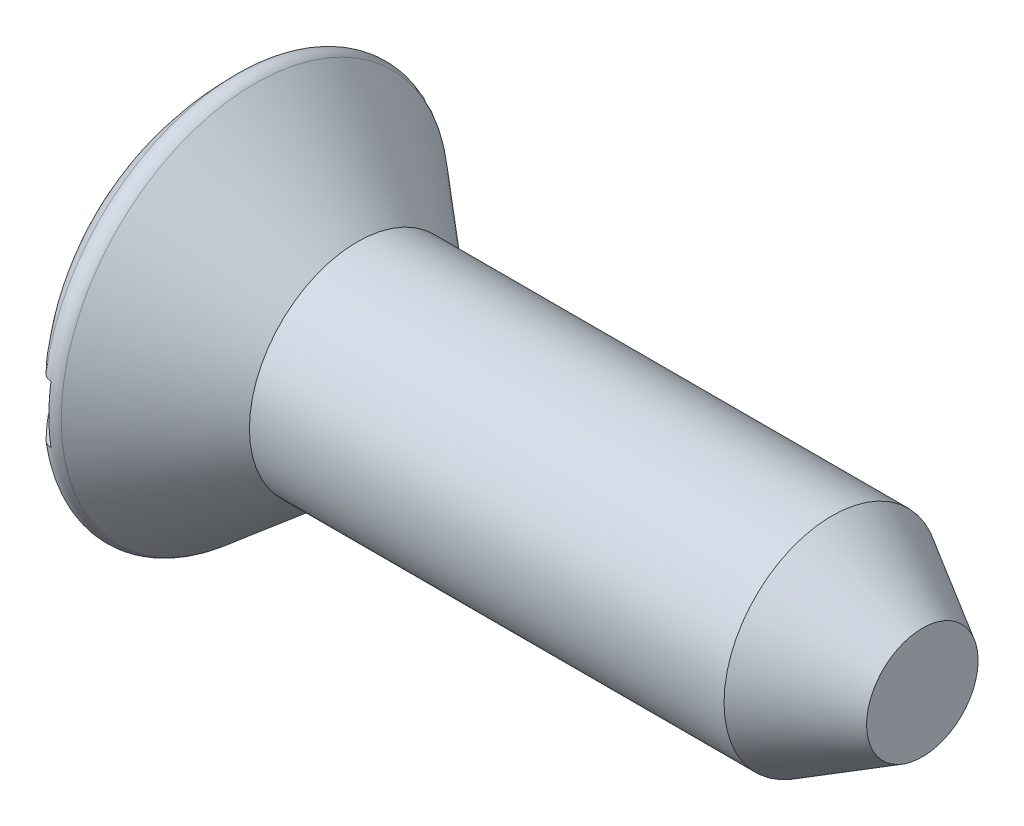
ISO-10303-21;
HEADER;
FILE_DESCRIPTION(('STEP AP214'),'2;1');
FILE_NAME('part.step','',(''),(''),'','','');
FILE_SCHEMA(('AUTOMOTIVE_DESIGN { 1 0 10303 214 1 1 1 1 }'));
ENDSEC;
DATA;
#1=APPLICATION_CONTEXT('core data for automotive mechanical design processes');
#2=APPLICATION_PROTOCOL_DEFINITION('international standard','automotive_design',2000,#1);
#3=PRODUCT_CONTEXT('',#1,'mechanical');
#4=PRODUCT('Part','Part','',(#3));
#5=PRODUCT_RELATED_PRODUCT_CATEGORY('part','',(#4));
#6=PRODUCT_DEFINITION_FORMATION('','',#4);
#7=PRODUCT_DEFINITION_CONTEXT('part definition',#1,'design');
#8=PRODUCT_DEFINITION('design','',#6,#7);
#9=PRODUCT_DEFINITION_SHAPE('','',#8);
#10=(LENGTH_UNIT() NAMED_UNIT(*) SI_UNIT(.MILLI.,.METRE.));
#11=(NAMED_UNIT(*) PLANE_ANGLE_UNIT() SI_UNIT($,.RADIAN.));
#12=(NAMED_UNIT(*) SI_UNIT($,.STERADIAN.) SOLID_ANGLE_UNIT());
#13=UNCERTAINTY_MEASURE_WITH_UNIT(LENGTH_MEASURE(1.E-05),#10,'distance_accuracy_value','');
#14=(GEOMETRIC_REPRESENTATION_CONTEXT(3) GLOBAL_UNCERTAINTY_ASSIGNED_CONTEXT((#13)) GLOBAL_UNIT_ASSIGNED_CONTEXT((#10,
#11,#12)) REPRESENTATION_CONTEXT('',''));
#15=CARTESIAN_POINT('',(0.,0.,0.));
#16=DIRECTION('',(0.,0.,1.));
#17=DIRECTION('',(1.,0.,0.));
#18=AXIS2_PLACEMENT_3D('',#15,#16,#17);
#19=CARTESIAN_POINT('',(0.,0.,0.));
#20=DIRECTION('',(-1.,0.,0.));
#21=DIRECTION('',(0.,0.,1.));
#22=AXIS2_PLACEMENT_3D('',#19,#20,#21);
#23=CYLINDRICAL_SURFACE('',#22,0.762);
#24=CARTESIAN_POINT('',(0.787034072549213,0.,0.));
#25=DIRECTION('',(-1.,0.,0.));
#26=DIRECTION('',(0.,0.,1.));
#27=AXIS2_PLACEMENT_3D('',#24,#25,#26);
#28=CIRCLE('',#27,0.762);
#29=CARTESIAN_POINT('',(0.787034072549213,0.,0.762));
#30=VERTEX_POINT('',#29);
#31=EDGE_CURVE('E164',#30,#30,#28,.T.);
#32=ORIENTED_EDGE('',*,*,#31,.F.);
#33=EDGE_LOOP('',(#32));
#34=FACE_BOUND('',#33,.T.);
#35=CARTESIAN_POINT('',(4.13728568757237,0.,0.));
#36=DIRECTION('',(-1.,0.,0.));
#37=DIRECTION('',(0.,0.,1.));
#38=AXIS2_PLACEMENT_3D('',#35,#36,#37);
#39=CIRCLE('',#38,0.762);
#40=CARTESIAN_POINT('',(4.13728568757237,0.,0.762));
#41=VERTEX_POINT('',#40);
#42=EDGE_CURVE('E190',#41,#41,#39,.T.);
#43=ORIENTED_EDGE('',*,*,#42,.T.);
#44=EDGE_LOOP('',(#43));
#45=FACE_BOUND('',#44,.T.);
#46=ADVANCED_FACE('F76',(#34,#45),#23,.T.);
#47=CARTESIAN_POINT('',(1.27448752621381,0.,0.));
#48=DIRECTION('',(-1.,0.,0.));
#49=DIRECTION('',(0.,1.,0.));
#50=AXIS2_PLACEMENT_3D('',#47,#48,#49);
#51=SPHERICAL_SURFACE('',#50,1.9098534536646);
#52=CARTESIAN_POINT('',(-0.0629338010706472,0.,0.));
#53=DIRECTION('',(-1.,0.,0.));
#54=DIRECTION('',(0.,0.,1.));
#55=AXIS2_PLACEMENT_3D('',#52,#53,#54);
#56=CIRCLE('',#55,1.36339444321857);
#57=CARTESIAN_POINT('',(-0.0629338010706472,0.2032,1.34816696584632));
#58=VERTEX_POINT('',#57);
#59=CARTESIAN_POINT('',(-0.0629338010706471,0.2032,-1.34816696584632));
#60=VERTEX_POINT('',#59);
#61=EDGE_CURVE('E174',#58,#60,#56,.T.);
#62=ORIENTED_EDGE('',*,*,#61,.T.);
#63=CARTESIAN_POINT('',(1.27448752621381,0.2032,0.));
#64=DIRECTION('',(0.,1.,0.));
#65=DIRECTION('',(-1.,0.,0.));
#66=AXIS2_PLACEMENT_3D('',#63,#64,#65);
#67=CIRCLE('',#66,1.89901289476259);
#68=EDGE_CURVE('E104',#60,#58,#67,.T.);
#69=ORIENTED_EDGE('',*,*,#68,.T.);
#70=EDGE_LOOP('',(#62,#69));
#71=FACE_BOUND('',#70,.T.);
#72=ADVANCED_FACE('F186',(#71),#51,.T.);
#73=CARTESIAN_POINT('',(-0.0629338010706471,-0.2032,-1.34816696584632));
#74=VERTEX_POINT('',#73);
#75=CARTESIAN_POINT('',(-0.0629338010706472,-0.2032,1.34816696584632));
#76=VERTEX_POINT('',#75);
#77=EDGE_CURVE('E141',#74,#76,#56,.T.);
#78=ORIENTED_EDGE('',*,*,#77,.T.);
#79=CARTESIAN_POINT('',(1.27448752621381,-0.2032,0.));
#80=DIRECTION('',(0.,-1.,0.));
#81=DIRECTION('',(1.,0.,0.));
#82=AXIS2_PLACEMENT_3D('',#79,#80,#81);
#83=CIRCLE('',#82,1.89901289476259);
#84=EDGE_CURVE('E96',#76,#74,#83,.T.);
#85=ORIENTED_EDGE('',*,*,#84,.T.);
#86=EDGE_LOOP('',(#78,#85));
#87=FACE_BOUND('',#86,.T.);
#88=ADVANCED_FACE('F78',(#87),#51,.T.);
#89=CARTESIAN_POINT('',(0.787034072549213,0.,0.));
#90=DIRECTION('',(-1.,0.,0.));
#91=DIRECTION('',(0.,0.,1.));
#92=AXIS2_PLACEMENT_3D('',#89,#90,#91);
#93=CONICAL_SURFACE('',#92,0.762,0.698131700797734);
#94=CARTESIAN_POINT('',(0.0644242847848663,0.,0.));
#95=DIRECTION('',(-1.,0.,0.));
#96=DIRECTION('',(0.,0.,1.));
#97=AXIS2_PLACEMENT_3D('',#94,#95,#96);
#98=CIRCLE('',#97,1.36834160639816);
#99=CARTESIAN_POINT('',(0.0644242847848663,0.,1.36834160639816));
#100=VERTEX_POINT('',#99);
#101=EDGE_CURVE('E176',#100,#100,#98,.T.);
#102=ORIENTED_EDGE('',*,*,#101,.F.);
#103=EDGE_LOOP('',(#102));
#104=FACE_BOUND('',#103,.T.);
#105=ORIENTED_EDGE('',*,*,#31,.T.);
#106=EDGE_LOOP('',(#105));
#107=FACE_BOUND('',#106,.T.);
#108=ADVANCED_FACE('F182',(#104,#107),#93,.T.);
#109=CARTESIAN_POINT('',(0.00347087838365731,0.,0.));
#110=DIRECTION('',(-1.,0.,0.));
#111=DIRECTION('',(0.,0.,1.));
#112=AXIS2_PLACEMENT_3D('',#109,#110,#111);
#113=TOROIDAL_SURFACE('',#112,1.29570016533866,0.0948266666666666);
#114=CARTESIAN_POINT('',(-0.000365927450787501,0.,0.));
#115=DIRECTION('',(1.,0.,0.));
#116=DIRECTION('',(0.,0.,-1.));
#117=AXIS2_PLACEMENT_3D('',#114,#115,#116);
#118=CIRCLE('',#117,1.39044917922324);
#119=CARTESIAN_POINT('',(-0.000365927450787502,-0.2032,-1.3755212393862));
#120=VERTEX_POINT('',#119);
#121=CARTESIAN_POINT('',(-0.000365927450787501,0.2032,-1.37552123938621));
#122=VERTEX_POINT('',#121);
#123=EDGE_CURVE('E89',#120,#122,#118,.T.);
#124=ORIENTED_EDGE('',*,*,#123,.T.);
#125=CARTESIAN_POINT('',(-0.0212566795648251,0.2032,-1.37228324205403));
#126=CARTESIAN_POINT('',(-0.0263813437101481,0.2032,-1.37088366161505));
#127=CARTESIAN_POINT('',(-0.0313909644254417,0.2032,-1.36904755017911));
#128=CARTESIAN_POINT('',(-0.0410337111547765,0.2032,-1.36455645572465));
#129=CARTESIAN_POINT('',(-0.0456663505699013,0.2032,-1.36190043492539));
#130=CARTESIAN_POINT('',(-0.0544171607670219,0.2032,-1.35585170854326));
#131=CARTESIAN_POINT('',(-0.0585357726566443,0.2032,-1.35245964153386));
#132=CARTESIAN_POINT('',(-0.0661488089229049,0.2032,-1.34503770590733));
#133=CARTESIAN_POINT('',(-0.0696433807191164,0.2032,-1.34100798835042));
#134=CARTESIAN_POINT('',(-0.0759392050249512,0.2032,-1.33239429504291));
#135=CARTESIAN_POINT('',(-0.0787352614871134,0.2032,-1.32780652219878));
#136=CARTESIAN_POINT('',(-0.0835272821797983,0.2032,-1.31823043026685));
#137=CARTESIAN_POINT('',(-0.0855231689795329,0.2032,-1.31324207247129));
#138=CARTESIAN_POINT('',(-0.0886806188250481,0.2032,-1.30294780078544));
#139=CARTESIAN_POINT('',(-0.0898327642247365,0.2032,-1.29763899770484));
#140=CARTESIAN_POINT('',(-0.0912372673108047,0.2032,-1.28690363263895));
#141=CARTESIAN_POINT('',(-0.091489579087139,0.2032,-1.28147706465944));
#142=CARTESIAN_POINT('',(-0.0910870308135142,0.2032,-1.27061403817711));
#143=CARTESIAN_POINT('',(-0.0904248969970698,0.2032,-1.26517784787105));
#144=CARTESIAN_POINT('',(-0.0881986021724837,0.2032,-1.25449327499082));
#145=CARTESIAN_POINT('',(-0.0866344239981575,0.2032,-1.24924489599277));
#146=CARTESIAN_POINT('',(-0.0826436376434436,0.2032,-1.23907987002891));
#147=CARTESIAN_POINT('',(-0.0802160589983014,0.2032,-1.23416360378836));
#148=CARTESIAN_POINT('',(-0.0745642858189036,0.2032,-1.22481230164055));
#149=CARTESIAN_POINT('',(-0.0713401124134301,0.2032,-1.22037725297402));
#150=CARTESIAN_POINT('',(-0.0642096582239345,0.2032,-1.21215018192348));
#151=CARTESIAN_POINT('',(-0.0603084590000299,0.2032,-1.20835375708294));
#152=CARTESIAN_POINT('',(-0.0519167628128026,0.2032,-1.20148016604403));
#153=CARTESIAN_POINT('',(-0.0474263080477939,0.2032,-1.19840294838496));
#154=CARTESIAN_POINT('',(-0.03804572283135,0.2032,-1.19309806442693));
#155=CARTESIAN_POINT('',(-0.0331615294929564,0.2032,-1.19085990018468));
#156=CARTESIAN_POINT('',(-0.0230835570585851,0.2032,-1.18724721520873));
#157=CARTESIAN_POINT('',(-0.0178898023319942,0.2032,-1.18587262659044));
#158=CARTESIAN_POINT('',(-0.00740999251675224,0.2032,-1.1840421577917));
#159=CARTESIAN_POINT('',(-0.00212590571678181,0.2032,-1.18357499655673));
#160=CARTESIAN_POINT('',(0.00844513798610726,0.2032,-1.18353982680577));
#161=CARTESIAN_POINT('',(0.0137320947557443,0.2032,-1.18397177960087));
#162=CARTESIAN_POINT('',(0.0241287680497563,0.2032,-1.18571642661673));
#163=CARTESIAN_POINT('',(0.0292392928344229,0.2032,-1.18702431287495));
#164=CARTESIAN_POINT('',(0.0391697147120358,0.2032,-1.19047576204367));
#165=CARTESIAN_POINT('',(0.043989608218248,0.2032,-1.1926193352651));
#166=CARTESIAN_POINT('',(0.0532266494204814,0.2032,-1.19768908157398));
#167=CARTESIAN_POINT('',(0.0576418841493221,0.2032,-1.20061873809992));
#168=CARTESIAN_POINT('',(0.0659253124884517,0.2032,-1.20716955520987));
#169=CARTESIAN_POINT('',(0.0697934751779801,0.2032,-1.21079075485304));
#170=CARTESIAN_POINT('',(0.0769227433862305,0.2032,-1.21866740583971));
#171=CARTESIAN_POINT('',(0.0801760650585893,0.2032,-1.22292990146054));
#172=CARTESIAN_POINT('',(0.0859319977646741,0.2032,-1.23193469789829));
#173=CARTESIAN_POINT('',(0.0884345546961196,0.2032,-1.23667703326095));
#174=CARTESIAN_POINT('',(0.092651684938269,0.2032,-1.246574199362));
#175=CARTESIAN_POINT('',(0.0943554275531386,0.2032,-1.2517336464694));
#176=CARTESIAN_POINT('',(0.0968806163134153,0.2032,-1.26226416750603));
#177=CARTESIAN_POINT('',(0.0977020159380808,0.2032,-1.26763525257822));
#178=CARTESIAN_POINT('',(0.0984435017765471,0.2032,-1.2784843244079));
#179=CARTESIAN_POINT('',(0.0983560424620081,0.2032,-1.28396282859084));
#180=CARTESIAN_POINT('',(0.0972629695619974,0.2032,-1.29482761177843));
#181=CARTESIAN_POINT('',(0.0962573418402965,0.2032,-1.30021388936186));
#182=CARTESIAN_POINT('',(0.0933534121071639,0.2032,-1.31074162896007));
#183=CARTESIAN_POINT('',(0.0914549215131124,0.2032,-1.31588303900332));
#184=CARTESIAN_POINT('',(0.0868156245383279,0.2032,-1.32577082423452));
#185=CARTESIAN_POINT('',(0.0840748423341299,0.2032,-1.33051721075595));
#186=CARTESIAN_POINT('',(0.0778483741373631,0.2032,-1.33944284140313));
#187=CARTESIAN_POINT('',(0.0743681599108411,0.2032,-1.34362590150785));
#188=CARTESIAN_POINT('',(0.0667479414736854,0.2032,-1.35134012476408));
#189=CARTESIAN_POINT('',(0.0626080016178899,0.2032,-1.35487135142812));
#190=CARTESIAN_POINT('',(0.0538347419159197,0.2032,-1.36114030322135));
#191=CARTESIAN_POINT('',(0.0492073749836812,0.2032,-1.3638863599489));
#192=CARTESIAN_POINT('',(0.0395524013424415,0.2032,-1.36855408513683));
#193=CARTESIAN_POINT('',(0.03452471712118,0.2032,-1.37047559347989));
#194=CARTESIAN_POINT('',(0.0242658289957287,0.2032,-1.37342025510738));
#195=CARTESIAN_POINT('',(0.0190370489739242,0.2032,-1.37445187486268));
#196=CARTESIAN_POINT('',(0.00848485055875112,0.2032,-1.37561550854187));
#197=CARTESIAN_POINT('',(0.00316156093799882,0.2032,-1.3757486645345));
#198=CARTESIAN_POINT('',(-0.00536234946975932,0.2032,-1.37523918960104));
#199=CARTESIAN_POINT('',(-0.00858238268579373,0.2032,-1.37487844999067));
#200=CARTESIAN_POINT('',(-0.0149680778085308,0.2032,-1.37382692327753));
#201=CARTESIAN_POINT('',(-0.018133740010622,0.2032,-1.37313613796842));
#202=CARTESIAN_POINT('',(-0.0212566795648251,0.2032,-1.37228324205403));
#203=B_SPLINE_CURVE_WITH_KNOTS('',3,(#125,#126,#127,#128,#129,#130,#131,#132,#133,#134,#135,
#136,#137,#138,#139,#140,#141,#142,#143,#144,#145,#146,#147,#148,#149,#150,#151,#152,#153,#154,
#155,#156,#157,#158,#159,#160,#161,#162,#163,#164,#165,#166,#167,#168,#169,#170,#171,#172,#173,
#174,#175,#176,#177,#178,#179,#180,#181,#182,#183,#184,#185,#186,#187,#188,#189,#190,#191,#192,
#193,#194,#195,#196,#197,#198,#199,#200,#201,#202),.UNSPECIFIED.,.T.,.F.,(4,2,2,2,2,2,2,2,2,2,2,
2,2,2,2,2,2,2,2,2,2,2,2,2,2,2,2,2,2,2,2,2,2,2,2,2,2,2,4),(0.,0.015925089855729,
0.0318704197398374,0.0478019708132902,0.0637297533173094,0.0797727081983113,0.0958172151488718,
0.112038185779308,0.128259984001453,0.144611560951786,0.160963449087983,0.177333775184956,
0.193703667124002,0.20995562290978,0.226206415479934,0.242246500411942,0.258285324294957,
0.274123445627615,0.289960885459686,0.30571209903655,0.321463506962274,0.337285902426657,
0.353109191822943,0.36912105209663,0.385134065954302,0.401358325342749,0.417583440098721,
0.43394336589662,0.450303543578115,0.466667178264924,0.483030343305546,0.499276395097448,
0.515520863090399,0.53158595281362,0.547654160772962,0.563567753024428,0.57946111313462,
0.589165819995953,0.598870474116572),.UNSPECIFIED.);
#204=EDGE_CURVE('E49',#122,#60,#203,.T.);
#205=ORIENTED_EDGE('',*,*,#204,.T.);
#206=ORIENTED_EDGE('',*,*,#61,.F.);
#207=CARTESIAN_POINT('',(-0.0259243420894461,0.2032,1.18829611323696));
#208=CARTESIAN_POINT('',(-0.0309775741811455,0.2032,1.18996790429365));
#209=CARTESIAN_POINT('',(-0.0358921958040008,0.2032,1.19207179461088));
#210=CARTESIAN_POINT('',(-0.0453006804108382,0.2032,1.19707967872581));
#211=CARTESIAN_POINT('',(-0.0497939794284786,0.2032,1.19998472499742));
#212=CARTESIAN_POINT('',(-0.0582263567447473,0.2032,1.20650306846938));
#213=CARTESIAN_POINT('',(-0.0621660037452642,0.2032,1.21011562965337));
#214=CARTESIAN_POINT('',(-0.0693889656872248,0.2032,1.2179439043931));
#215=CARTESIAN_POINT('',(-0.0726724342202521,0.2032,1.2221594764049));
#216=CARTESIAN_POINT('',(-0.0785273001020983,0.2032,1.23111901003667));
#217=CARTESIAN_POINT('',(-0.081091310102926,0.2032,1.23586779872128));
#218=CARTESIAN_POINT('',(-0.0853963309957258,0.2032,1.24572505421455));
#219=CARTESIAN_POINT('',(-0.0871372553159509,0.2032,1.25083355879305));
#220=CARTESIAN_POINT('',(-0.089765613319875,0.2032,1.26132843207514));
#221=CARTESIAN_POINT('',(-0.0906429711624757,0.2032,1.26671732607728));
#222=CARTESIAN_POINT('',(-0.0914852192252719,0.2032,1.27756605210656));
#223=CARTESIAN_POINT('',(-0.0914500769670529,0.2032,1.28302588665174));
#224=CARTESIAN_POINT('',(-0.0904650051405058,0.2032,1.29388823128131));
#225=CARTESIAN_POINT('',(-0.0895108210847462,0.2032,1.29929035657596));
#226=CARTESIAN_POINT('',(-0.0867058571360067,0.2032,1.30985673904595));
#227=CARTESIAN_POINT('',(-0.0848550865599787,0.2032,1.31502099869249));
#228=CARTESIAN_POINT('',(-0.0803143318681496,0.2032,1.32494419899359));
#229=CARTESIAN_POINT('',(-0.0776273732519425,0.2032,1.32970452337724));
#230=CARTESIAN_POINT('',(-0.0714851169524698,0.2032,1.33870075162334));
#231=CARTESIAN_POINT('',(-0.0680298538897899,0.2032,1.34293667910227));
#232=CARTESIAN_POINT('',(-0.0604836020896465,0.2032,1.35072015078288));
#233=CARTESIAN_POINT('',(-0.0563989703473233,0.2032,1.35427385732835));
#234=CARTESIAN_POINT('',(-0.0476853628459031,0.2032,1.36063582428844));
#235=CARTESIAN_POINT('',(-0.0430564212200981,0.2032,1.3634441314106));
#236=CARTESIAN_POINT('',(-0.0334409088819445,0.2032,1.36820302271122));
#237=CARTESIAN_POINT('',(-0.0284588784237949,0.2032,1.37016278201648));
#238=CARTESIAN_POINT('',(-0.018234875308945,0.2032,1.37321012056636));
#239=CARTESIAN_POINT('',(-0.0129929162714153,0.2032,1.374297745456));
#240=CARTESIAN_POINT('',(-0.00244462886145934,0.2032,1.37556232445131));
#241=CARTESIAN_POINT('',(0.00286080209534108,0.2032,1.3757467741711));
#242=CARTESIAN_POINT('',(0.0134268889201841,0.2032,1.37521977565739));
#243=CARTESIAN_POINT('',(0.0186875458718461,0.2032,1.37450834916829));
#244=CARTESIAN_POINT('',(0.029000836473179,0.2032,1.37221410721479));
#245=CARTESIAN_POINT('',(0.0340539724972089,0.2032,1.37063354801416));
#246=CARTESIAN_POINT('',(0.0438246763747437,0.2032,1.36664975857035));
#247=CARTESIAN_POINT('',(0.0485422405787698,0.2032,1.36424651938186));
#248=CARTESIAN_POINT('',(0.0575289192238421,0.2032,1.35867708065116));
#249=CARTESIAN_POINT('',(0.0617961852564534,0.2032,1.35550789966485));
#250=CARTESIAN_POINT('',(0.0697441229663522,0.2032,1.34850406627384));
#251=CARTESIAN_POINT('',(0.0734247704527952,0.2032,1.34466938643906));
#252=CARTESIAN_POINT('',(0.0801315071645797,0.2032,1.33640662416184));
#253=CARTESIAN_POINT('',(0.0831513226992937,0.2032,1.33197345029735));
#254=CARTESIAN_POINT('',(0.0884133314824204,0.2032,1.32266748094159));
#255=CARTESIAN_POINT('',(0.0906554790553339,0.2032,1.31779465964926));
#256=CARTESIAN_POINT('',(0.0943243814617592,0.2032,1.30768997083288));
#257=CARTESIAN_POINT('',(0.0957418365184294,0.2032,1.30245472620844));
#258=CARTESIAN_POINT('',(0.0976861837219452,0.2032,1.29182137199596));
#259=CARTESIAN_POINT('',(0.098213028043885,0.2032,1.2864232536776));
#260=CARTESIAN_POINT('',(0.0983639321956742,0.2032,1.27556709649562));
#261=CARTESIAN_POINT('',(0.0979800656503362,0.2032,1.27010894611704));
#262=CARTESIAN_POINT('',(0.0963038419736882,0.2032,1.25933382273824));
#263=CARTESIAN_POINT('',(0.0950114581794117,0.2032,1.25401685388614));
#264=CARTESIAN_POINT('',(0.0915487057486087,0.2032,1.24366282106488));
#265=CARTESIAN_POINT('',(0.0893762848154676,0.2032,1.23862644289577));
#266=CARTESIAN_POINT('',(0.0842118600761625,0.2032,1.22899282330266));
#267=CARTESIAN_POINT('',(0.0812198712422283,0.2032,1.22439557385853));
#268=CARTESIAN_POINT('',(0.0745182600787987,0.2032,1.21580187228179));
#269=CARTESIAN_POINT('',(0.0708130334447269,0.2032,1.21180199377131));
#270=CARTESIAN_POINT('',(0.062776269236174,0.2032,1.20449080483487));
#271=CARTESIAN_POINT('',(0.0584447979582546,0.2032,1.20117942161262));
#272=CARTESIAN_POINT('',(0.0493361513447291,0.2032,1.19538394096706));
#273=CARTESIAN_POINT('',(0.0445652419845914,0.2032,1.19288999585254));
#274=CARTESIAN_POINT('',(0.0346671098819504,0.2032,1.18875007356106));
#275=CARTESIAN_POINT('',(0.0295398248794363,0.2032,1.18710424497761));
#276=CARTESIAN_POINT('',(0.0191457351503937,0.2032,1.18472850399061));
#277=CARTESIAN_POINT('',(0.0138814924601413,0.2032,1.18398734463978));
#278=CARTESIAN_POINT('',(0.00330811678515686,0.2032,1.18340756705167));
#279=CARTESIAN_POINT('',(-0.00200094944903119,0.2032,1.18356778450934));
#280=CARTESIAN_POINT('',(-0.0104264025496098,0.2032,1.18454047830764));
#281=CARTESIAN_POINT('',(-0.0135781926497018,0.2032,1.1850693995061));
#282=CARTESIAN_POINT('',(-0.0198113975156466,0.2032,1.18644574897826));
#283=CARTESIAN_POINT('',(-0.0228928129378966,0.2032,1.18729317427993));
#284=CARTESIAN_POINT('',(-0.0259243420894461,0.2032,1.18829611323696));
#285=B_SPLINE_CURVE_WITH_KNOTS('',3,(#207,#208,#209,#210,#211,#212,#213,#214,#215,#216,#217,
#218,#219,#220,#221,#222,#223,#224,#225,#226,#227,#228,#229,#230,#231,#232,#233,#234,#235,#236,
#237,#238,#239,#240,#241,#242,#243,#244,#245,#246,#247,#248,#249,#250,#251,#252,#253,#254,#255,
#256,#257,#258,#259,#260,#261,#262,#263,#264,#265,#266,#267,#268,#269,#270,#271,#272,#273,#274,
#275,#276,#277,#278,#279,#280,#281,#282,#283,#284),.UNSPECIFIED.,.T.,.F.,(4,2,2,2,2,2,2,2,2,2,2,
2,2,2,2,2,2,2,2,2,2,2,2,2,2,2,2,2,2,2,2,2,2,2,2,2,2,2,4),(0.,0.0159559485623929,
0.0319329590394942,0.0478934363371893,0.0638501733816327,0.0799652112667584,0.0960819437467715,
0.112384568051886,0.128687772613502,0.145066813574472,0.161445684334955,0.177765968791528,
0.194085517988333,0.210249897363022,0.226413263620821,0.242397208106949,0.258380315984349,
0.274230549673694,0.290080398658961,0.305889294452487,0.321698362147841,0.337569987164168,
0.353442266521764,0.36945925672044,0.38547718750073,0.401672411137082,0.417868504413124,
0.434206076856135,0.450544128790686,0.466920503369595,0.483296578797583,0.499574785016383,
0.515851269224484,0.531923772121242,0.547999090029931,0.563872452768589,0.57972531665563,
0.589297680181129,0.598869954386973),.UNSPECIFIED.);
#286=CARTESIAN_POINT('',(-0.000365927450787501,0.2032,1.37552123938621));
#287=VERTEX_POINT('',#286);
#288=EDGE_CURVE('E142',#58,#287,#285,.T.);
#289=ORIENTED_EDGE('',*,*,#288,.T.);
#290=CARTESIAN_POINT('',(-0.000365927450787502,-0.2032,1.37552123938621));
#291=VERTEX_POINT('',#290);
#292=EDGE_CURVE('E132',#287,#291,#118,.T.);
#293=ORIENTED_EDGE('',*,*,#292,.T.);
#294=CARTESIAN_POINT('',(-0.0259243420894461,-0.2032,1.18829611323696));
#295=CARTESIAN_POINT('',(-0.0209339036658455,-0.2032,1.18664560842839));
#296=CARTESIAN_POINT('',(-0.0158010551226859,-0.2032,1.18541406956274));
#297=CARTESIAN_POINT('',(-0.00539741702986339,-0.2032,1.18382970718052));
#298=CARTESIAN_POINT('',(-0.00012648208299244,-0.2032,1.18347785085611));
#299=CARTESIAN_POINT('',(0.0103977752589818,-0.2032,1.18366559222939));
#300=CARTESIAN_POINT('',(0.0156511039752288,-0.2032,1.18420482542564));
#301=CARTESIAN_POINT('',(0.0259912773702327,-0.2032,1.18615732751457));
#302=CARTESIAN_POINT('',(0.0310781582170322,-0.2032,1.18757040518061));
#303=CARTESIAN_POINT('',(0.0409465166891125,-0.2032,1.19122792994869));
#304=CARTESIAN_POINT('',(0.0457278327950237,-0.2032,1.19347281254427));
#305=CARTESIAN_POINT('',(0.0548505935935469,-0.2032,1.198726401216));
#306=CARTESIAN_POINT('',(0.0591920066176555,-0.2032,1.20173516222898));
#307=CARTESIAN_POINT('',(0.0673557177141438,-0.2032,1.20845942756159));
#308=CARTESIAN_POINT('',(0.0711728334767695,-0.2032,1.21218122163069));
#309=CARTESIAN_POINT('',(0.0781382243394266,-0.2032,1.22020527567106));
#310=CARTESIAN_POINT('',(0.0812864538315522,-0.2032,1.22450757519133));
#311=CARTESIAN_POINT('',(0.0868694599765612,-0.2032,1.23363265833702));
#312=CARTESIAN_POINT('',(0.0892940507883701,-0.2032,1.23846167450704));
#313=CARTESIAN_POINT('',(0.0933083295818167,-0.2032,1.24845508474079));
#314=CARTESIAN_POINT('',(0.0948979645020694,-0.2032,1.25361950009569));
#315=CARTESIAN_POINT('',(0.0972135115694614,-0.2032,1.26419858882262));
#316=CARTESIAN_POINT('',(0.0979296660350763,-0.2032,1.26961539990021));
#317=CARTESIAN_POINT('',(0.0984463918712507,-0.2032,1.28049263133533));
#318=CARTESIAN_POINT('',(0.0982469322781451,-0.2032,1.28595305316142));
#319=CARTESIAN_POINT('',(0.0969341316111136,-0.2032,1.29678479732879));
#320=CARTESIAN_POINT('',(0.0958172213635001,-0.2032,1.30215568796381));
#321=CARTESIAN_POINT('',(0.0926937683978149,-0.2032,1.31263239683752));
#322=CARTESIAN_POINT('',(0.0906872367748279,-0.2032,1.31773821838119));
#323=CARTESIAN_POINT('',(0.0858485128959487,-0.2032,1.32751554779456));
#324=CARTESIAN_POINT('',(0.0830198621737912,-0.2032,1.33218880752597));
#325=CARTESIAN_POINT('',(0.0766107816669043,-0.2032,1.34098790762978));
#326=CARTESIAN_POINT('',(0.0730303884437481,-0.2032,1.34511377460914));
#327=CARTESIAN_POINT('',(0.065256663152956,-0.2032,1.35265700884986));
#328=CARTESIAN_POINT('',(0.0610697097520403,-0.2032,1.35608094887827));
#329=CARTESIAN_POINT('',(0.0521750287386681,-0.2032,1.36216794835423));
#330=CARTESIAN_POINT('',(0.0474673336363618,-0.2032,1.3648310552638));
#331=CARTESIAN_POINT('',(0.0377206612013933,-0.2032,1.36929033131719));
#332=CARTESIAN_POINT('',(0.0326859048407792,-0.2032,1.37109572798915));
#333=CARTESIAN_POINT('',(0.0223834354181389,-0.2032,1.37382803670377));
#334=CARTESIAN_POINT('',(0.0171157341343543,-0.2032,1.37475499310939));
#335=CARTESIAN_POINT('',(0.00654147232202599,-0.2032,1.37569841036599));
#336=CARTESIAN_POINT('',(0.00123554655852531,-0.2032,1.37572199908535));
#337=CARTESIAN_POINT('',(-0.00930452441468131,-0.2032,1.37487604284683));
#338=CARTESIAN_POINT('',(-0.0145386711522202,-0.2032,1.37400651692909));
#339=CARTESIAN_POINT('',(-0.0247761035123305,-0.2032,1.37140319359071));
#340=CARTESIAN_POINT('',(-0.0297798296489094,-0.2032,1.36967112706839));
#341=CARTESIAN_POINT('',(-0.0394273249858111,-0.2032,1.36539517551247));
#342=CARTESIAN_POINT('',(-0.0440710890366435,-0.2032,1.36285127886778));
#343=CARTESIAN_POINT('',(-0.0528902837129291,-0.2032,1.35701319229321));
#344=CARTESIAN_POINT('',(-0.0570635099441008,-0.2032,1.35371567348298));
#345=CARTESIAN_POINT('',(-0.0648035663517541,-0.2032,1.34647280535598));
#346=CARTESIAN_POINT('',(-0.0683703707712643,-0.2032,1.34252742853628));
#347=CARTESIAN_POINT('',(-0.0748329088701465,-0.2032,1.33406150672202));
#348=CARTESIAN_POINT('',(-0.0777219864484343,-0.2032,1.32953588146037));
#349=CARTESIAN_POINT('',(-0.0827089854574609,-0.2032,1.32006796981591));
#350=CARTESIAN_POINT('',(-0.0848068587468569,-0.2032,1.31512565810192));
#351=CARTESIAN_POINT('',(-0.0881758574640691,-0.2032,1.30490623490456));
#352=CARTESIAN_POINT('',(-0.0894376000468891,-0.2032,1.2996260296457));
#353=CARTESIAN_POINT('',(-0.0910648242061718,-0.2032,1.28892923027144));
#354=CARTESIAN_POINT('',(-0.0914302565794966,-0.2032,1.28351262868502));
#355=CARTESIAN_POINT('',(-0.0912554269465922,-0.2032,1.27264875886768));
#356=CARTESIAN_POINT('',(-0.0907075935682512,-0.2032,1.26720161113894));
#357=CARTESIAN_POINT('',(-0.0887069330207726,-0.2032,1.25647618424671));
#358=CARTESIAN_POINT('',(-0.0872541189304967,-0.2032,1.25119790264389));
#359=CARTESIAN_POINT('',(-0.0834795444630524,-0.2032,1.24095237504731));
#360=CARTESIAN_POINT('',(-0.0811564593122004,-0.2032,1.23598561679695));
#361=CARTESIAN_POINT('',(-0.0757033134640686,-0.2032,1.22651480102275));
#362=CARTESIAN_POINT('',(-0.0725730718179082,-0.2032,1.22201084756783));
#363=CARTESIAN_POINT('',(-0.0656142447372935,-0.2032,1.21362728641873));
#364=CARTESIAN_POINT('',(-0.0617901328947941,-0.2032,1.20974396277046));
#365=CARTESIAN_POINT('',(-0.0535395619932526,-0.2032,1.20268850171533));
#366=CARTESIAN_POINT('',(-0.0491138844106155,-0.2032,1.19951545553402));
#367=CARTESIAN_POINT('',(-0.0415283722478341,-0.2032,1.19500867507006));
#368=CARTESIAN_POINT('',(-0.0385112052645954,-0.2032,1.19343010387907));
#369=CARTESIAN_POINT('',(-0.0323240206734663,-0.2032,1.19060790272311));
#370=CARTESIAN_POINT('',(-0.0291540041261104,-0.2032,1.18936427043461));
#371=CARTESIAN_POINT('',(-0.0259243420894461,-0.2032,1.18829611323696));
#372=B_SPLINE_CURVE_WITH_KNOTS('',3,(#294,#295,#296,#297,#298,#299,#300,#301,#302,#303,#304,
#305,#306,#307,#308,#309,#310,#311,#312,#313,#314,#315,#316,#317,#318,#319,#320,#321,#322,#323,
#324,#325,#326,#327,#328,#329,#330,#331,#332,#333,#334,#335,#336,#337,#338,#339,#340,#341,#342,
#343,#344,#345,#346,#347,#348,#349,#350,#351,#352,#353,#354,#355,#356,#357,#358,#359,#360,#361,
#362,#363,#364,#365,#366,#367,#368,#369,#370,#371),.UNSPECIFIED.,.T.,.F.,(4,2,2,2,2,2,2,2,2,2,2,
2,2,2,2,2,2,2,2,2,2,2,2,2,2,2,2,2,2,2,2,2,2,2,2,2,2,2,4),(0.,0.015756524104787,
0.0315303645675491,0.0472977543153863,0.0630616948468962,0.0788339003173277,0.0946072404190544,
0.110526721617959,0.126447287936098,0.142582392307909,0.158718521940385,0.175033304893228,
0.19134863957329,0.207727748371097,0.224106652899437,0.240416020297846,0.256724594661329,
0.272872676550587,0.28901975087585,0.304988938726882,0.320957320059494,0.336799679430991,
0.352641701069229,0.368452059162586,0.384262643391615,0.40014446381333,0.416026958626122,
0.432059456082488,0.448092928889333,0.464303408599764,0.480514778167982,0.49686121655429,
0.5132074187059,0.529578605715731,0.545953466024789,0.562226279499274,0.578478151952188,
0.588675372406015,0.598872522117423),.UNSPECIFIED.);
#373=EDGE_CURVE('E134',#291,#76,#372,.T.);
#374=ORIENTED_EDGE('',*,*,#373,.T.);
#375=ORIENTED_EDGE('',*,*,#77,.F.);
#376=CARTESIAN_POINT('',(-0.0212566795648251,-0.2032,-1.37228324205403));
#377=CARTESIAN_POINT('',(-0.0161697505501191,-0.2032,-1.37367201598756));
#378=CARTESIAN_POINT('',(-0.0109620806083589,-0.2032,-1.37463272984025));
#379=CARTESIAN_POINT('',(-0.000455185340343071,-0.2032,-1.37566637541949));
#380=CARTESIAN_POINT('',(0.00484413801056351,-0.2032,-1.37573828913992));
#381=CARTESIAN_POINT('',(0.0153774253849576,-0.2032,-1.37499062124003));
#382=CARTESIAN_POINT('',(0.020611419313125,-0.2032,-1.37417146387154));
#383=CARTESIAN_POINT('',(0.0308663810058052,-0.2032,-1.37166702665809));
#384=CARTESIAN_POINT('',(0.035887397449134,-0.2032,-1.36998194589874));
#385=CARTESIAN_POINT('',(0.0455823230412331,-0.2032,-1.36579371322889));
#386=CARTESIAN_POINT('',(0.0502558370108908,-0.2032,-1.36328964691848));
#387=CARTESIAN_POINT('',(0.0591202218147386,-0.2032,-1.35753764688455));
#388=CARTESIAN_POINT('',(0.0633110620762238,-0.2032,-1.35428966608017));
#389=CARTESIAN_POINT('',(0.0711239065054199,-0.2032,-1.34711836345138));
#390=CARTESIAN_POINT('',(0.0747416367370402,-0.2032,-1.34319038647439));
#391=CARTESIAN_POINT('',(0.0812746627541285,-0.2032,-1.33478838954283));
#392=CARTESIAN_POINT('',(0.0841899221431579,-0.2032,-1.33031434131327));
#393=CARTESIAN_POINT('',(0.0892686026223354,-0.2032,-1.32089613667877));
#394=CARTESIAN_POINT('',(0.0914236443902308,-0.2032,-1.31594746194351));
#395=CARTESIAN_POINT('',(0.0948819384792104,-0.2032,-1.30576096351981));
#396=CARTESIAN_POINT('',(0.0961851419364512,-0.2032,-1.30052312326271));
#397=CARTESIAN_POINT('',(0.0979155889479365,-0.2032,-1.28984915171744));
#398=CARTESIAN_POINT('',(0.0983336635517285,-0.2032,-1.28441153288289));
#399=CARTESIAN_POINT('',(0.0982565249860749,-0.2032,-1.27354267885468));
#400=CARTESIAN_POINT('',(0.0977612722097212,-0.2032,-1.26811144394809));
#401=CARTESIAN_POINT('',(0.0958658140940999,-0.2032,-1.25737788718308));
#402=CARTESIAN_POINT('',(0.0944605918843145,-0.2032,-1.25207645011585));
#403=CARTESIAN_POINT('',(0.0907781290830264,-0.2032,-1.24178542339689));
#404=CARTESIAN_POINT('',(0.08850088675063,-0.2032,-1.23679583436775));
#405=CARTESIAN_POINT('',(0.0831419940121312,-0.2032,-1.22728411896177));
#406=CARTESIAN_POINT('',(0.0800622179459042,-0.2032,-1.22276093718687));
#407=CARTESIAN_POINT('',(0.0731797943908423,-0.2032,-1.21430253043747));
#408=CARTESIAN_POINT('',(0.0693771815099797,-0.2032,-1.21036727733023));
#409=CARTESIAN_POINT('',(0.0611970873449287,-0.2032,-1.20324042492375));
#410=CARTESIAN_POINT('',(0.0568258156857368,-0.2032,-1.20004170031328));
#411=CARTESIAN_POINT('',(0.0476022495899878,-0.2032,-1.1944355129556));
#412=CARTESIAN_POINT('',(0.0427499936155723,-0.2032,-1.19202798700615));
#413=CARTESIAN_POINT('',(0.0327733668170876,-0.2032,-1.18810690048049));
#414=CARTESIAN_POINT('',(0.0276536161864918,-0.2032,-1.18658158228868));
#415=CARTESIAN_POINT('',(0.0172295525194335,-0.2032,-1.18442217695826));
#416=CARTESIAN_POINT('',(0.0119252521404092,-0.2032,-1.18378802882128));
#417=CARTESIAN_POINT('',(0.00134100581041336,-0.2032,-1.18343277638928));
#418=CARTESIAN_POINT('',(-0.00393862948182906,-0.2032,-1.18370234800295));
#419=CARTESIAN_POINT('',(-0.0143772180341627,-0.2032,-1.18512553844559));
#420=CARTESIAN_POINT('',(-0.0195361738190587,-0.2032,-1.18627913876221));
#421=CARTESIAN_POINT('',(-0.0295804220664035,-0.2032,-1.18943247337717));
#422=CARTESIAN_POINT('',(-0.034466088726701,-0.2032,-1.1914310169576));
#423=CARTESIAN_POINT('',(-0.0438363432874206,-0.2032,-1.19621356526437));
#424=CARTESIAN_POINT('',(-0.0483209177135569,-0.2032,-1.19899759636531));
#425=CARTESIAN_POINT('',(-0.0568019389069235,-0.2032,-1.20529454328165));
#426=CARTESIAN_POINT('',(-0.0607941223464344,-0.2032,-1.20881319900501));
#427=CARTESIAN_POINT('',(-0.0681406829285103,-0.2032,-1.21646288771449));
#428=CARTESIAN_POINT('',(-0.0714950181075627,-0.2032,-1.22059396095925));
#429=CARTESIAN_POINT('',(-0.0775179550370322,-0.2032,-1.22940981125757));
#430=CARTESIAN_POINT('',(-0.0801768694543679,-0.2032,-1.23410120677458));
#431=CARTESIAN_POINT('',(-0.0846800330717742,-0.2032,-1.24385993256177));
#432=CARTESIAN_POINT('',(-0.0865242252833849,-0.2032,-1.24892728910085));
#433=CARTESIAN_POINT('',(-0.089366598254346,-0.2032,-1.2593585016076));
#434=CARTESIAN_POINT('',(-0.0903545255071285,-0.2032,-1.26472515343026));
#435=CARTESIAN_POINT('',(-0.0914205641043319,-0.2032,-1.2755481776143));
#436=CARTESIAN_POINT('',(-0.0914986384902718,-0.2032,-1.28100455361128));
#437=CARTESIAN_POINT('',(-0.0907400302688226,-0.2032,-1.29188193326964));
#438=CARTESIAN_POINT('',(-0.0898986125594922,-0.2032,-1.29730260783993));
#439=CARTESIAN_POINT('',(-0.0873149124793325,-0.2032,-1.3079247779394));
#440=CARTESIAN_POINT('',(-0.0855726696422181,-0.2032,-1.31312628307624));
#441=CARTESIAN_POINT('',(-0.0812405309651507,-0.2032,-1.32314376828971));
#442=CARTESIAN_POINT('',(-0.0786533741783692,-0.2032,-1.32796093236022));
#443=CARTESIAN_POINT('',(-0.0726990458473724,-0.2032,-1.33708836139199));
#444=CARTESIAN_POINT('',(-0.0693317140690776,-0.2032,-1.34139852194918));
#445=CARTESIAN_POINT('',(-0.0619445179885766,-0.2032,-1.3493464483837));
#446=CARTESIAN_POINT('',(-0.0579306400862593,-0.2032,-1.35298978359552));
#447=CARTESIAN_POINT('',(-0.0493452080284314,-0.2032,-1.35953792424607));
#448=CARTESIAN_POINT('',(-0.0447743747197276,-0.2032,-1.36244366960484));
#449=CARTESIAN_POINT('',(-0.0370122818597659,-0.2032,-1.36649126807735));
#450=CARTESIAN_POINT('',(-0.0339497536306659,-0.2032,-1.36788528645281));
#451=CARTESIAN_POINT('',(-0.0276933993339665,-0.2032,-1.37033860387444));
#452=CARTESIAN_POINT('',(-0.0244995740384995,-0.2032,-1.37139790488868));
#453=CARTESIAN_POINT('',(-0.0212566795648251,-0.2032,-1.37228324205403));
#454=B_SPLINE_CURVE_WITH_KNOTS('',3,(#376,#377,#378,#379,#380,#381,#382,#383,#384,#385,#386,
#387,#388,#389,#390,#391,#392,#393,#394,#395,#396,#397,#398,#399,#400,#401,#402,#403,#404,#405,
#406,#407,#408,#409,#410,#411,#412,#413,#414,#415,#416,#417,#418,#419,#420,#421,#422,#423,#424,
#425,#426,#427,#428,#429,#430,#431,#432,#433,#434,#435,#436,#437,#438,#439,#440,#441,#442,#443,
#444,#445,#446,#447,#448,#449,#450,#451,#452,#453),.UNSPECIFIED.,.T.,.F.,(4,2,2,2,2,2,2,2,2,2,2,
2,2,2,2,2,2,2,2,2,2,2,2,2,2,2,2,2,2,2,2,2,2,2,2,2,2,2,4),(0.,0.0158070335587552,
0.0316321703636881,0.0474497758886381,0.0632637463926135,0.0790954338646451,0.0949281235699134,
0.110873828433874,0.126820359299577,0.142937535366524,0.159055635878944,0.175339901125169,
0.191624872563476,0.208000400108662,0.224375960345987,0.240713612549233,0.257050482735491,
0.273221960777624,0.289392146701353,0.305341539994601,0.321289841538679,0.337074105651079,
0.352858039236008,0.368619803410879,0.384382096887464,0.400272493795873,0.416163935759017,
0.43226619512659,0.448369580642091,0.464663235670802,0.480957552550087,0.497336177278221,
0.513714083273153,0.530039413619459,0.546368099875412,0.562553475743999,0.578718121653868,
0.588795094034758,0.598872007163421),.UNSPECIFIED.);
#455=EDGE_CURVE('E130',#74,#120,#454,.T.);
#456=ORIENTED_EDGE('',*,*,#455,.T.);
#457=EDGE_LOOP('',(#124,#205,#206,#289,#293,#374,#375,#456));
#458=FACE_BOUND('',#457,.T.);
#459=ORIENTED_EDGE('',*,*,#101,.T.);
#460=EDGE_LOOP('',(#459));
#461=FACE_BOUND('',#460,.T.);
#462=ADVANCED_FACE('F138',(#458,#461),#113,.T.);
#463=CARTESIAN_POINT('',(-0.635365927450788,0.2032,-1.39052683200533));
#464=DIRECTION('',(0.,1.,0.));
#465=DIRECTION('',(-1.,0.,0.));
#466=AXIS2_PLACEMENT_3D('',#463,#464,#465);
#467=PLANE('',#466);
#468=DIRECTION('',(0.,0.,1.));
#469=VECTOR('',#468,1.);
#470=CARTESIAN_POINT('',(-0.000365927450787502,0.2032,-1.39052683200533));
#471=LINE('',#470,#469);
#472=EDGE_CURVE('E127',#122,#287,#471,.T.);
#473=ORIENTED_EDGE('',*,*,#472,.T.);
#474=ORIENTED_EDGE('',*,*,#288,.F.);
#475=ORIENTED_EDGE('',*,*,#68,.F.);
#476=ORIENTED_EDGE('',*,*,#204,.F.);
#477=EDGE_LOOP('',(#473,#474,#475,#476));
#478=FACE_BOUND('',#477,.T.);
#479=ADVANCED_FACE('F167',(#478),#467,.F.);
#480=CARTESIAN_POINT('',(-0.000365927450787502,0.2032,-1.39052683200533));
#481=DIRECTION('',(1.,0.,0.));
#482=DIRECTION('',(0.,0.,-1.));
#483=AXIS2_PLACEMENT_3D('',#480,#481,#482);
#484=PLANE('',#483);
#485=ORIENTED_EDGE('',*,*,#472,.F.);
#486=ORIENTED_EDGE('',*,*,#123,.F.);
#487=DIRECTION('',(0.,0.,1.));
#488=VECTOR('',#487,1.);
#489=CARTESIAN_POINT('',(-0.000365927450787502,-0.2032,-1.39052683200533));
#490=LINE('',#489,#488);
#491=EDGE_CURVE('E124',#120,#291,#490,.T.);
#492=ORIENTED_EDGE('',*,*,#491,.T.);
#493=ORIENTED_EDGE('',*,*,#292,.F.);
#494=EDGE_LOOP('',(#485,#486,#492,#493));
#495=FACE_BOUND('',#494,.T.);
#496=ADVANCED_FACE('F123',(#495),#484,.F.);
#497=CARTESIAN_POINT('',(-0.635365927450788,-0.2032,-1.39052683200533));
#498=DIRECTION('',(0.,-1.,0.));
#499=DIRECTION('',(1.,0.,0.));
#500=AXIS2_PLACEMENT_3D('',#497,#498,#499);
#501=PLANE('',#500);
#502=ORIENTED_EDGE('',*,*,#84,.F.);
#503=ORIENTED_EDGE('',*,*,#373,.F.);
#504=ORIENTED_EDGE('',*,*,#491,.F.);
#505=ORIENTED_EDGE('',*,*,#455,.F.);
#506=EDGE_LOOP('',(#502,#503,#504,#505));
#507=FACE_BOUND('',#506,.T.);
#508=ADVANCED_FACE('F133',(#507),#501,.F.);
#509=CARTESIAN_POINT('',(4.13728568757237,0.,0.));
#510=DIRECTION('',(-1.,0.,0.));
#511=DIRECTION('',(0.,0.,1.));
#512=AXIS2_PLACEMENT_3D('',#509,#510,#511);
#513=CONICAL_SURFACE('',#512,0.762,0.523598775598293);
#514=CARTESIAN_POINT('',(4.7752,0.,0.));
#515=DIRECTION('',(-1.,0.,0.));
#516=DIRECTION('',(0.,0.,1.));
#517=AXIS2_PLACEMENT_3D('',#514,#515,#516);
#518=CIRCLE('',#517,0.3937);
#519=CARTESIAN_POINT('',(4.7752,0.,0.3937));
#520=VERTEX_POINT('',#519);
#521=EDGE_CURVE('E135',#520,#520,#518,.T.);
#522=ORIENTED_EDGE('',*,*,#521,.T.);
#523=EDGE_LOOP('',(#522));
#524=FACE_BOUND('',#523,.T.);
#525=ORIENTED_EDGE('',*,*,#42,.F.);
#526=EDGE_LOOP('',(#525));
#527=FACE_BOUND('',#526,.T.);
#528=ADVANCED_FACE('F157',(#524,#527),#513,.T.);
#529=CARTESIAN_POINT('',(4.7752,0.762,0.));
#530=DIRECTION('',(-1.,0.,0.));
#531=DIRECTION('',(0.,0.,1.));
#532=AXIS2_PLACEMENT_3D('',#529,#530,#531);
#533=PLANE('',#532);
#534=ORIENTED_EDGE('',*,*,#521,.F.);
#535=EDGE_LOOP('',(#534));
#536=FACE_BOUND('',#535,.T.);
#537=ADVANCED_FACE('F196',(#536),#533,.F.);
#538=CLOSED_SHELL('',(#46,#72,#88,#108,#462,#479,#496,#508,#528,#537));
#539=MANIFOLD_SOLID_BREP('B6',#538);
#540=ADVANCED_BREP_SHAPE_REPRESENTATION('',(#18,#539),#14);
#541=SHAPE_DEFINITION_REPRESENTATION(#9,#540);
ENDSEC;
END-ISO-10303-21;
